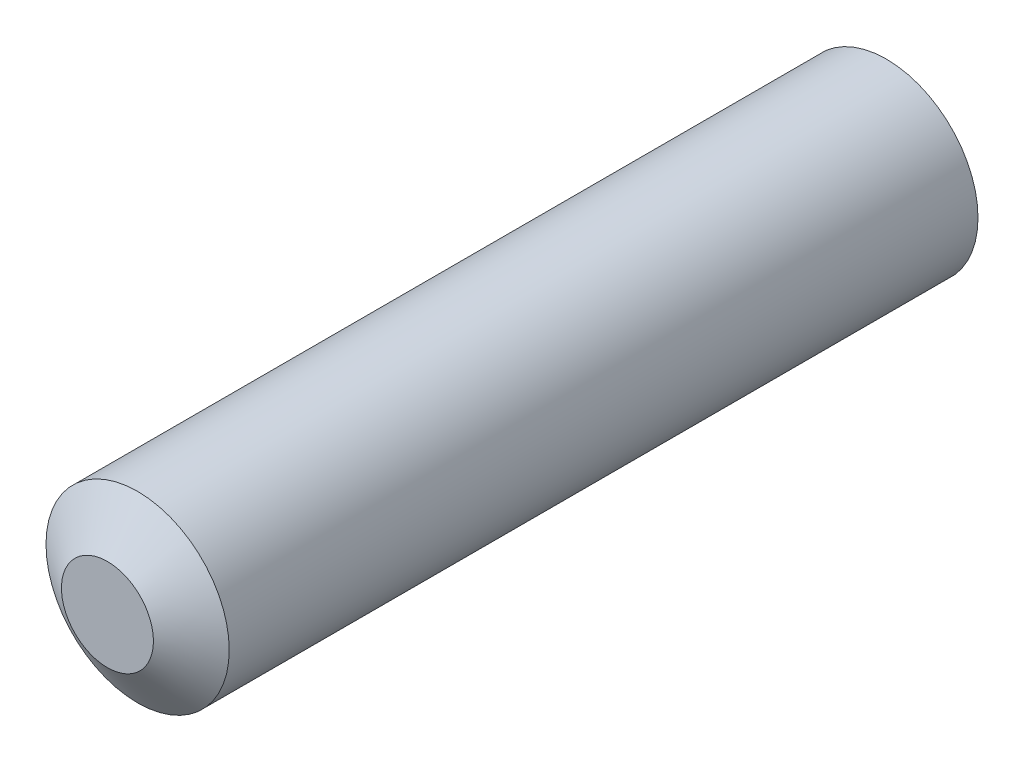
ISO-10303-21;
HEADER;
FILE_DESCRIPTION(('STEP AP214'),'2;1');
FILE_NAME('part.step','',(''),(''),'','','');
FILE_SCHEMA(('AUTOMOTIVE_DESIGN { 1 0 10303 214 1 1 1 1 }'));
ENDSEC;
DATA;
#1=APPLICATION_CONTEXT('core data for automotive mechanical design processes');
#2=APPLICATION_PROTOCOL_DEFINITION('international standard','automotive_design',2000,#1);
#3=PRODUCT_CONTEXT('',#1,'mechanical');
#4=PRODUCT('Part','Part','',(#3));
#5=PRODUCT_RELATED_PRODUCT_CATEGORY('part','',(#4));
#6=PRODUCT_DEFINITION_FORMATION('','',#4);
#7=PRODUCT_DEFINITION_CONTEXT('part definition',#1,'design');
#8=PRODUCT_DEFINITION('design','',#6,#7);
#9=PRODUCT_DEFINITION_SHAPE('','',#8);
#10=(LENGTH_UNIT() NAMED_UNIT(*) SI_UNIT(.MILLI.,.METRE.));
#11=(NAMED_UNIT(*) PLANE_ANGLE_UNIT() SI_UNIT($,.RADIAN.));
#12=(NAMED_UNIT(*) SI_UNIT($,.STERADIAN.) SOLID_ANGLE_UNIT());
#13=UNCERTAINTY_MEASURE_WITH_UNIT(LENGTH_MEASURE(1.E-05),#10,'distance_accuracy_value','');
#14=(GEOMETRIC_REPRESENTATION_CONTEXT(3) GLOBAL_UNCERTAINTY_ASSIGNED_CONTEXT((#13)) GLOBAL_UNIT_ASSIGNED_CONTEXT((#10,
#11,#12)) REPRESENTATION_CONTEXT('',''));
#15=CARTESIAN_POINT('',(0.,0.,0.));
#16=DIRECTION('',(0.,0.,1.));
#17=DIRECTION('',(1.,0.,0.));
#18=AXIS2_PLACEMENT_3D('',#15,#16,#17);
#19=CARTESIAN_POINT('',(0.,0.,-11.26));
#20=DIRECTION('',(0.,0.,1.));
#21=DIRECTION('',(1.,0.,0.));
#22=AXIS2_PLACEMENT_3D('',#19,#20,#21);
#23=CYLINDRICAL_SURFACE('',#22,1.275);
#24=CARTESIAN_POINT('',(0.,0.,-10.84));
#25=DIRECTION('',(0.,0.,1.));
#26=DIRECTION('',(1.,0.,0.));
#27=AXIS2_PLACEMENT_3D('',#24,#25,#26);
#28=CIRCLE('',#27,1.275);
#29=CARTESIAN_POINT('',(1.275,0.,-10.84));
#30=VERTEX_POINT('',#29);
#31=EDGE_CURVE('E40',#30,#30,#28,.T.);
#32=ORIENTED_EDGE('',*,*,#31,.T.);
#33=EDGE_LOOP('',(#32));
#34=FACE_BOUND('',#33,.T.);
#35=CARTESIAN_POINT('',(0.,0.,-0.420000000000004));
#36=DIRECTION('',(0.,0.,1.));
#37=DIRECTION('',(1.,0.,0.));
#38=AXIS2_PLACEMENT_3D('',#35,#36,#37);
#39=CIRCLE('',#38,1.275);
#40=CARTESIAN_POINT('',(1.275,0.,-0.420000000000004));
#41=VERTEX_POINT('',#40);
#42=EDGE_CURVE('E44',#41,#41,#39,.F.);
#43=ORIENTED_EDGE('',*,*,#42,.T.);
#44=EDGE_LOOP('',(#43));
#45=FACE_BOUND('',#44,.T.);
#46=ADVANCED_FACE('F33',(#34,#45),#23,.T.);
#47=CARTESIAN_POINT('',(0.,0.,-11.26));
#48=DIRECTION('',(0.,0.,1.));
#49=DIRECTION('',(1.,0.,0.));
#50=AXIS2_PLACEMENT_3D('',#47,#48,#49);
#51=PLANE('',#50);
#52=CARTESIAN_POINT('',(0.,0.,-11.26));
#53=DIRECTION('',(0.,0.,1.));
#54=DIRECTION('',(1.,0.,0.));
#55=AXIS2_PLACEMENT_3D('',#52,#53,#54);
#56=CIRCLE('',#55,0.639999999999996);
#57=CARTESIAN_POINT('',(0.639999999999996,0.,-11.26));
#58=VERTEX_POINT('',#57);
#59=EDGE_CURVE('E10',#58,#58,#56,.F.);
#60=ORIENTED_EDGE('',*,*,#59,.T.);
#61=EDGE_LOOP('',(#60));
#62=FACE_BOUND('',#61,.T.);
#63=ADVANCED_FACE('F64',(#62),#51,.F.);
#64=CARTESIAN_POINT('',(0.,0.,0.));
#65=DIRECTION('',(0.,0.,1.));
#66=DIRECTION('',(1.,0.,0.));
#67=AXIS2_PLACEMENT_3D('',#64,#65,#66);
#68=PLANE('',#67);
#69=CARTESIAN_POINT('',(0.,0.,0.));
#70=DIRECTION('',(0.,0.,1.));
#71=DIRECTION('',(1.,0.,0.));
#72=AXIS2_PLACEMENT_3D('',#69,#70,#71);
#73=CIRCLE('',#72,0.639999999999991);
#74=CARTESIAN_POINT('',(0.639999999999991,0.,0.));
#75=VERTEX_POINT('',#74);
#76=EDGE_CURVE('E48',#75,#75,#73,.T.);
#77=ORIENTED_EDGE('',*,*,#76,.T.);
#78=EDGE_LOOP('',(#77));
#79=FACE_BOUND('',#78,.T.);
#80=ADVANCED_FACE('F54',(#79),#68,.T.);
#81=CARTESIAN_POINT('',(0.,0.,0.));
#82=DIRECTION('',(0.,0.,-1.));
#83=DIRECTION('',(-1.,0.,0.));
#84=AXIS2_PLACEMENT_3D('',#81,#82,#83);
#85=CONICAL_SURFACE('',#84,0.639999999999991,0.986436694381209);
#86=ORIENTED_EDGE('',*,*,#42,.F.);
#87=EDGE_LOOP('',(#86));
#88=FACE_BOUND('',#87,.T.);
#89=ORIENTED_EDGE('',*,*,#76,.F.);
#90=EDGE_LOOP('',(#89));
#91=FACE_BOUND('',#90,.T.);
#92=ADVANCED_FACE('F56',(#88,#91),#85,.T.);
#93=CARTESIAN_POINT('',(0.,0.,-10.84));
#94=DIRECTION('',(0.,0.,1.));
#95=DIRECTION('',(1.,0.,0.));
#96=AXIS2_PLACEMENT_3D('',#93,#94,#95);
#97=CONICAL_SURFACE('',#96,1.275,0.986436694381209);
#98=ORIENTED_EDGE('',*,*,#59,.F.);
#99=EDGE_LOOP('',(#98));
#100=FACE_BOUND('',#99,.T.);
#101=ORIENTED_EDGE('',*,*,#31,.F.);
#102=EDGE_LOOP('',(#101));
#103=FACE_BOUND('',#102,.T.);
#104=ADVANCED_FACE('F35',(#100,#103),#97,.T.);
#105=CLOSED_SHELL('',(#46,#63,#80,#92,#104));
#106=MANIFOLD_SOLID_BREP('B2',#105);
#107=ADVANCED_BREP_SHAPE_REPRESENTATION('',(#18,#106),#14);
#108=SHAPE_DEFINITION_REPRESENTATION(#9,#107);
ENDSEC;
END-ISO-10303-21;
